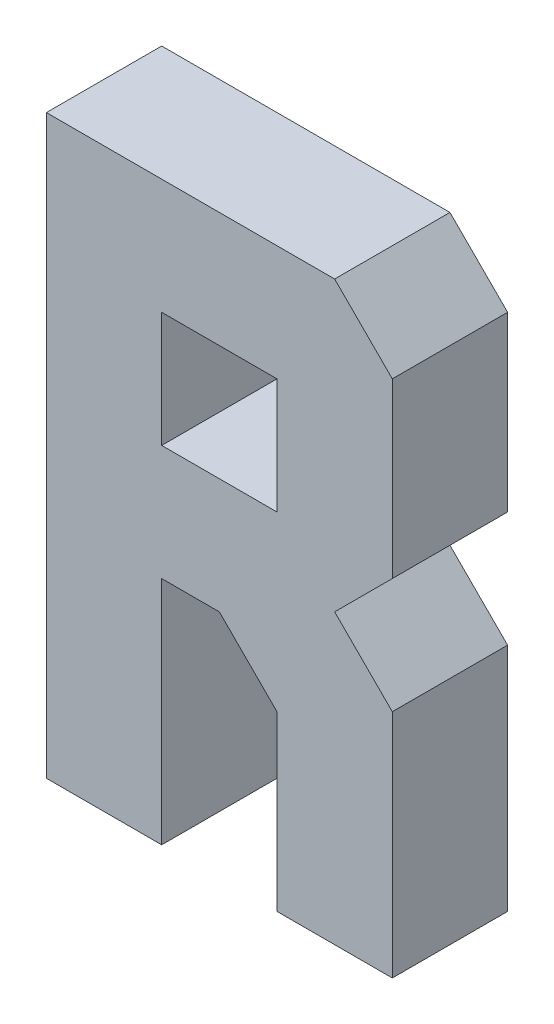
ISO-10303-21;
HEADER;
FILE_DESCRIPTION(('STEP AP214'),'2;1');
FILE_NAME('part.step','',(''),(''),'','','');
FILE_SCHEMA(('AUTOMOTIVE_DESIGN { 1 0 10303 214 1 1 1 1 }'));
ENDSEC;
DATA;
#1=APPLICATION_CONTEXT('core data for automotive mechanical design processes');
#2=APPLICATION_PROTOCOL_DEFINITION('international standard','automotive_design',2000,#1);
#3=PRODUCT_CONTEXT('',#1,'mechanical');
#4=PRODUCT('Part','Part','',(#3));
#5=PRODUCT_RELATED_PRODUCT_CATEGORY('part','',(#4));
#6=PRODUCT_DEFINITION_FORMATION('','',#4);
#7=PRODUCT_DEFINITION_CONTEXT('part definition',#1,'design');
#8=PRODUCT_DEFINITION('design','',#6,#7);
#9=PRODUCT_DEFINITION_SHAPE('','',#8);
#10=(LENGTH_UNIT() NAMED_UNIT(*) SI_UNIT(.MILLI.,.METRE.));
#11=(NAMED_UNIT(*) PLANE_ANGLE_UNIT() SI_UNIT($,.RADIAN.));
#12=(NAMED_UNIT(*) SI_UNIT($,.STERADIAN.) SOLID_ANGLE_UNIT());
#13=UNCERTAINTY_MEASURE_WITH_UNIT(LENGTH_MEASURE(1.E-05),#10,'distance_accuracy_value','');
#14=(GEOMETRIC_REPRESENTATION_CONTEXT(3) GLOBAL_UNCERTAINTY_ASSIGNED_CONTEXT((#13)) GLOBAL_UNIT_ASSIGNED_CONTEXT((#10,
#11,#12)) REPRESENTATION_CONTEXT('',''));
#15=CARTESIAN_POINT('',(0.,0.,0.));
#16=DIRECTION('',(0.,0.,1.));
#17=DIRECTION('',(1.,0.,0.));
#18=AXIS2_PLACEMENT_3D('',#15,#16,#17);
#19=CARTESIAN_POINT('',(0.,0.,10.));
#20=DIRECTION('',(0.,0.,-1.));
#21=DIRECTION('',(-1.,0.,0.));
#22=AXIS2_PLACEMENT_3D('',#19,#20,#21);
#23=PLANE('',#22);
#24=DIRECTION('',(0.,1.,0.));
#25=VECTOR('',#24,1.);
#26=CARTESIAN_POINT('',(30.,50.,10.));
#27=LINE('',#26,#25);
#28=CARTESIAN_POINT('',(30.,30.,10.));
#29=VERTEX_POINT('',#28);
#30=CARTESIAN_POINT('',(30.,45.,10.));
#31=VERTEX_POINT('',#30);
#32=EDGE_CURVE('E213',#29,#31,#27,.T.);
#33=ORIENTED_EDGE('',*,*,#32,.T.);
#34=DIRECTION('',(0.707106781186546,-0.707106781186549,0.));
#35=VECTOR('',#34,1.);
#36=CARTESIAN_POINT('',(25.,50.,10.));
#37=LINE('',#36,#35);
#38=CARTESIAN_POINT('',(25.,50.,10.));
#39=VERTEX_POINT('',#38);
#40=EDGE_CURVE('E11',#31,#39,#37,.F.);
#41=ORIENTED_EDGE('',*,*,#40,.T.);
#42=DIRECTION('',(-1.,0.,0.));
#43=VECTOR('',#42,1.);
#44=CARTESIAN_POINT('',(13.8454038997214,50.,10.));
#45=LINE('',#44,#43);
#46=CARTESIAN_POINT('',(0.,50.,10.));
#47=VERTEX_POINT('',#46);
#48=EDGE_CURVE('E215',#39,#47,#45,.T.);
#49=ORIENTED_EDGE('',*,*,#48,.T.);
#50=DIRECTION('',(0.,-1.,0.));
#51=VECTOR('',#50,1.);
#52=CARTESIAN_POINT('',(0.,0.,10.));
#53=LINE('',#52,#51);
#54=CARTESIAN_POINT('',(0.,0.,10.));
#55=VERTEX_POINT('',#54);
#56=EDGE_CURVE('E195',#47,#55,#53,.T.);
#57=ORIENTED_EDGE('',*,*,#56,.T.);
#58=DIRECTION('',(1.,0.,0.));
#59=VECTOR('',#58,1.);
#60=CARTESIAN_POINT('',(0.,0.,10.));
#61=LINE('',#60,#59);
#62=CARTESIAN_POINT('',(10.,0.,10.));
#63=VERTEX_POINT('',#62);
#64=EDGE_CURVE('E198',#55,#63,#61,.T.);
#65=ORIENTED_EDGE('',*,*,#64,.T.);
#66=DIRECTION('',(0.,1.,0.));
#67=VECTOR('',#66,1.);
#68=CARTESIAN_POINT('',(10.,0.,10.));
#69=LINE('',#68,#67);
#70=CARTESIAN_POINT('',(10.,20.,10.));
#71=VERTEX_POINT('',#70);
#72=EDGE_CURVE('E201',#63,#71,#69,.T.);
#73=ORIENTED_EDGE('',*,*,#72,.T.);
#74=DIRECTION('',(1.,0.,0.));
#75=VECTOR('',#74,1.);
#76=CARTESIAN_POINT('',(10.,20.,10.));
#77=LINE('',#76,#75);
#78=CARTESIAN_POINT('',(15.,20.,10.));
#79=VERTEX_POINT('',#78);
#80=EDGE_CURVE('E203',#71,#79,#77,.T.);
#81=ORIENTED_EDGE('',*,*,#80,.T.);
#82=DIRECTION('',(-0.707106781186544,0.707106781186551,0.));
#83=VECTOR('',#82,1.);
#84=CARTESIAN_POINT('',(17.5000000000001,17.4999999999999,10.));
#85=LINE('',#84,#83);
#86=CARTESIAN_POINT('',(20.,15.,10.));
#87=VERTEX_POINT('',#86);
#88=EDGE_CURVE('E266',#79,#87,#85,.F.);
#89=ORIENTED_EDGE('',*,*,#88,.T.);
#90=DIRECTION('',(0.,-1.,0.));
#91=VECTOR('',#90,1.);
#92=CARTESIAN_POINT('',(20.,0.,10.));
#93=LINE('',#92,#91);
#94=CARTESIAN_POINT('',(20.,0.,10.));
#95=VERTEX_POINT('',#94);
#96=EDGE_CURVE('E206',#87,#95,#93,.T.);
#97=ORIENTED_EDGE('',*,*,#96,.T.);
#98=DIRECTION('',(1.,0.,0.));
#99=VECTOR('',#98,1.);
#100=CARTESIAN_POINT('',(30.,0.,10.));
#101=LINE('',#100,#99);
#102=CARTESIAN_POINT('',(30.,0.,10.));
#103=VERTEX_POINT('',#102);
#104=EDGE_CURVE('E208',#95,#103,#101,.T.);
#105=ORIENTED_EDGE('',*,*,#104,.T.);
#106=DIRECTION('',(0.,1.,0.));
#107=VECTOR('',#106,1.);
#108=CARTESIAN_POINT('',(30.,0.,10.));
#109=LINE('',#108,#107);
#110=CARTESIAN_POINT('',(30.,20.,10.));
#111=VERTEX_POINT('',#110);
#112=EDGE_CURVE('E210',#103,#111,#109,.T.);
#113=ORIENTED_EDGE('',*,*,#112,.T.);
#114=DIRECTION('',(0.707106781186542,-0.707106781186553,0.));
#115=VECTOR('',#114,1.);
#116=CARTESIAN_POINT('',(25.0000000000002,24.9999999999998,10.));
#117=LINE('',#116,#115);
#118=CARTESIAN_POINT('',(25.,25.0000000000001,10.));
#119=VERTEX_POINT('',#118);
#120=EDGE_CURVE('E270',#111,#119,#117,.F.);
#121=ORIENTED_EDGE('',*,*,#120,.T.);
#122=DIRECTION('',(-0.707106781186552,-0.707106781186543,0.));
#123=VECTOR('',#122,1.);
#124=CARTESIAN_POINT('',(-1.71728862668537E-13,1.71728862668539E-13,10.));
#125=LINE('',#124,#123);
#126=EDGE_CURVE('E274',#119,#29,#125,.F.);
#127=ORIENTED_EDGE('',*,*,#126,.T.);
#128=EDGE_LOOP('',(#33,#41,#49,#57,#65,#73,#81,#89,#97,#105,#113,#121,#127));
#129=FACE_BOUND('',#128,.T.);
#130=DIRECTION('',(0.,-1.,0.));
#131=VECTOR('',#130,1.);
#132=CARTESIAN_POINT('',(10.,40.,10.));
#133=LINE('',#132,#131);
#134=CARTESIAN_POINT('',(10.,40.,10.));
#135=VERTEX_POINT('',#134);
#136=CARTESIAN_POINT('',(10.,30.,10.));
#137=VERTEX_POINT('',#136);
#138=EDGE_CURVE('E153',#135,#137,#133,.T.);
#139=ORIENTED_EDGE('',*,*,#138,.F.);
#140=DIRECTION('',(-1.,0.,0.));
#141=VECTOR('',#140,1.);
#142=CARTESIAN_POINT('',(10.,40.,10.));
#143=LINE('',#142,#141);
#144=CARTESIAN_POINT('',(20.,40.,10.));
#145=VERTEX_POINT('',#144);
#146=EDGE_CURVE('E178',#145,#135,#143,.T.);
#147=ORIENTED_EDGE('',*,*,#146,.F.);
#148=DIRECTION('',(0.,1.,0.));
#149=VECTOR('',#148,1.);
#150=CARTESIAN_POINT('',(20.,40.,10.));
#151=LINE('',#150,#149);
#152=CARTESIAN_POINT('',(20.,30.,10.));
#153=VERTEX_POINT('',#152);
#154=EDGE_CURVE('E176',#153,#145,#151,.T.);
#155=ORIENTED_EDGE('',*,*,#154,.F.);
#156=DIRECTION('',(1.,0.,0.));
#157=VECTOR('',#156,1.);
#158=CARTESIAN_POINT('',(10.,30.,10.));
#159=LINE('',#158,#157);
#160=EDGE_CURVE('E163',#137,#153,#159,.T.);
#161=ORIENTED_EDGE('',*,*,#160,.F.);
#162=EDGE_LOOP('',(#139,#147,#155,#161));
#163=FACE_BOUND('',#162,.T.);
#164=ADVANCED_FACE('F33',(#129,#163),#23,.F.);
#165=CARTESIAN_POINT('',(0.,0.,0.));
#166=DIRECTION('',(0.,0.,-1.));
#167=DIRECTION('',(-1.,0.,0.));
#168=AXIS2_PLACEMENT_3D('',#165,#166,#167);
#169=PLANE('',#168);
#170=DIRECTION('',(-1.,0.,0.));
#171=VECTOR('',#170,1.);
#172=CARTESIAN_POINT('',(0.,50.,0.));
#173=LINE('',#172,#171);
#174=CARTESIAN_POINT('',(25.,50.,0.));
#175=VERTEX_POINT('',#174);
#176=CARTESIAN_POINT('',(0.,50.,0.));
#177=VERTEX_POINT('',#176);
#178=EDGE_CURVE('E199',#175,#177,#173,.T.);
#179=ORIENTED_EDGE('',*,*,#178,.F.);
#180=DIRECTION('',(-0.707106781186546,0.707106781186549,0.));
#181=VECTOR('',#180,1.);
#182=CARTESIAN_POINT('',(37.5,37.4999999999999,0.));
#183=LINE('',#182,#181);
#184=CARTESIAN_POINT('',(30.,45.,0.));
#185=VERTEX_POINT('',#184);
#186=EDGE_CURVE('E55',#175,#185,#183,.F.);
#187=ORIENTED_EDGE('',*,*,#186,.T.);
#188=DIRECTION('',(0.,1.,0.));
#189=VECTOR('',#188,1.);
#190=CARTESIAN_POINT('',(30.,50.,0.));
#191=LINE('',#190,#189);
#192=CARTESIAN_POINT('',(30.,30.,0.));
#193=VERTEX_POINT('',#192);
#194=EDGE_CURVE('E234',#193,#185,#191,.T.);
#195=ORIENTED_EDGE('',*,*,#194,.F.);
#196=DIRECTION('',(0.707106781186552,0.707106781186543,0.));
#197=VECTOR('',#196,1.);
#198=CARTESIAN_POINT('',(30.,30.,0.));
#199=LINE('',#198,#197);
#200=CARTESIAN_POINT('',(25.,25.0000000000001,0.));
#201=VERTEX_POINT('',#200);
#202=EDGE_CURVE('E272',#193,#201,#199,.F.);
#203=ORIENTED_EDGE('',*,*,#202,.T.);
#204=DIRECTION('',(-0.707106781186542,0.707106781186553,0.));
#205=VECTOR('',#204,1.);
#206=CARTESIAN_POINT('',(25.,25.0000000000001,0.));
#207=LINE('',#206,#205);
#208=CARTESIAN_POINT('',(30.,20.,0.));
#209=VERTEX_POINT('',#208);
#210=EDGE_CURVE('E268',#201,#209,#207,.F.);
#211=ORIENTED_EDGE('',*,*,#210,.T.);
#212=DIRECTION('',(0.,1.,0.));
#213=VECTOR('',#212,1.);
#214=CARTESIAN_POINT('',(30.,0.,0.));
#215=LINE('',#214,#213);
#216=CARTESIAN_POINT('',(30.,0.,0.));
#217=VERTEX_POINT('',#216);
#218=EDGE_CURVE('E231',#217,#209,#215,.T.);
#219=ORIENTED_EDGE('',*,*,#218,.F.);
#220=DIRECTION('',(1.,0.,0.));
#221=VECTOR('',#220,1.);
#222=CARTESIAN_POINT('',(30.,0.,0.));
#223=LINE('',#222,#221);
#224=CARTESIAN_POINT('',(20.,0.,0.));
#225=VERTEX_POINT('',#224);
#226=EDGE_CURVE('E229',#225,#217,#223,.T.);
#227=ORIENTED_EDGE('',*,*,#226,.F.);
#228=DIRECTION('',(0.,-1.,0.));
#229=VECTOR('',#228,1.);
#230=CARTESIAN_POINT('',(20.,0.,0.));
#231=LINE('',#230,#229);
#232=CARTESIAN_POINT('',(20.,15.,0.));
#233=VERTEX_POINT('',#232);
#234=EDGE_CURVE('E227',#233,#225,#231,.T.);
#235=ORIENTED_EDGE('',*,*,#234,.F.);
#236=DIRECTION('',(0.707106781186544,-0.707106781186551,0.));
#237=VECTOR('',#236,1.);
#238=CARTESIAN_POINT('',(20.,15.,0.));
#239=LINE('',#238,#237);
#240=CARTESIAN_POINT('',(15.,20.,0.));
#241=VERTEX_POINT('',#240);
#242=EDGE_CURVE('E264',#233,#241,#239,.F.);
#243=ORIENTED_EDGE('',*,*,#242,.T.);
#244=DIRECTION('',(1.,0.,0.));
#245=VECTOR('',#244,1.);
#246=CARTESIAN_POINT('',(10.,20.,0.));
#247=LINE('',#246,#245);
#248=CARTESIAN_POINT('',(10.,20.,0.));
#249=VERTEX_POINT('',#248);
#250=EDGE_CURVE('E224',#249,#241,#247,.T.);
#251=ORIENTED_EDGE('',*,*,#250,.F.);
#252=DIRECTION('',(0.,1.,0.));
#253=VECTOR('',#252,1.);
#254=CARTESIAN_POINT('',(10.,0.,0.));
#255=LINE('',#254,#253);
#256=CARTESIAN_POINT('',(10.,0.,0.));
#257=VERTEX_POINT('',#256);
#258=EDGE_CURVE('E222',#257,#249,#255,.T.);
#259=ORIENTED_EDGE('',*,*,#258,.F.);
#260=DIRECTION('',(1.,0.,0.));
#261=VECTOR('',#260,1.);
#262=CARTESIAN_POINT('',(0.,0.,0.));
#263=LINE('',#262,#261);
#264=CARTESIAN_POINT('',(0.,0.,0.));
#265=VERTEX_POINT('',#264);
#266=EDGE_CURVE('E220',#265,#257,#263,.T.);
#267=ORIENTED_EDGE('',*,*,#266,.F.);
#268=DIRECTION('',(0.,-1.,0.));
#269=VECTOR('',#268,1.);
#270=CARTESIAN_POINT('',(0.,0.,0.));
#271=LINE('',#270,#269);
#272=EDGE_CURVE('E171',#177,#265,#271,.T.);
#273=ORIENTED_EDGE('',*,*,#272,.F.);
#274=EDGE_LOOP('',(#179,#187,#195,#203,#211,#219,#227,#235,#243,#251,#259,#267,#273));
#275=FACE_BOUND('',#274,.T.);
#276=DIRECTION('',(-1.,0.,0.));
#277=VECTOR('',#276,1.);
#278=CARTESIAN_POINT('',(10.,40.,0.));
#279=LINE('',#278,#277);
#280=CARTESIAN_POINT('',(20.,40.,0.));
#281=VERTEX_POINT('',#280);
#282=CARTESIAN_POINT('',(10.,40.,0.));
#283=VERTEX_POINT('',#282);
#284=EDGE_CURVE('E164',#281,#283,#279,.T.);
#285=ORIENTED_EDGE('',*,*,#284,.T.);
#286=DIRECTION('',(0.,-1.,0.));
#287=VECTOR('',#286,1.);
#288=CARTESIAN_POINT('',(10.,40.,0.));
#289=LINE('',#288,#287);
#290=CARTESIAN_POINT('',(10.,30.,0.));
#291=VERTEX_POINT('',#290);
#292=EDGE_CURVE('E182',#283,#291,#289,.T.);
#293=ORIENTED_EDGE('',*,*,#292,.T.);
#294=DIRECTION('',(1.,0.,0.));
#295=VECTOR('',#294,1.);
#296=CARTESIAN_POINT('',(10.,30.,0.));
#297=LINE('',#296,#295);
#298=CARTESIAN_POINT('',(20.,30.,0.));
#299=VERTEX_POINT('',#298);
#300=EDGE_CURVE('E170',#291,#299,#297,.T.);
#301=ORIENTED_EDGE('',*,*,#300,.T.);
#302=DIRECTION('',(0.,1.,0.));
#303=VECTOR('',#302,1.);
#304=CARTESIAN_POINT('',(20.,40.,0.));
#305=LINE('',#304,#303);
#306=EDGE_CURVE('E186',#299,#281,#305,.T.);
#307=ORIENTED_EDGE('',*,*,#306,.T.);
#308=EDGE_LOOP('',(#285,#293,#301,#307));
#309=FACE_BOUND('',#308,.T.);
#310=ADVANCED_FACE('F289',(#275,#309),#169,.T.);
#311=CARTESIAN_POINT('',(0.,0.,10.));
#312=DIRECTION('',(1.,0.,0.));
#313=DIRECTION('',(0.,0.,-1.));
#314=AXIS2_PLACEMENT_3D('',#311,#312,#313);
#315=PLANE('',#314);
#316=ORIENTED_EDGE('',*,*,#272,.T.);
#317=DIRECTION('',(0.,0.,-1.));
#318=VECTOR('',#317,1.);
#319=CARTESIAN_POINT('',(0.,0.,10.));
#320=LINE('',#319,#318);
#321=EDGE_CURVE('E256',#55,#265,#320,.T.);
#322=ORIENTED_EDGE('',*,*,#321,.F.);
#323=ORIENTED_EDGE('',*,*,#56,.F.);
#324=DIRECTION('',(0.,0.,-1.));
#325=VECTOR('',#324,1.);
#326=CARTESIAN_POINT('',(0.,50.,10.));
#327=LINE('',#326,#325);
#328=EDGE_CURVE('E217',#47,#177,#327,.T.);
#329=ORIENTED_EDGE('',*,*,#328,.T.);
#330=EDGE_LOOP('',(#316,#322,#323,#329));
#331=FACE_BOUND('',#330,.T.);
#332=ADVANCED_FACE('F294',(#331),#315,.F.);
#333=CARTESIAN_POINT('',(0.,0.,10.));
#334=DIRECTION('',(0.,1.,0.));
#335=DIRECTION('',(0.,0.,1.));
#336=AXIS2_PLACEMENT_3D('',#333,#334,#335);
#337=PLANE('',#336);
#338=ORIENTED_EDGE('',*,*,#266,.T.);
#339=DIRECTION('',(0.,0.,-1.));
#340=VECTOR('',#339,1.);
#341=CARTESIAN_POINT('',(10.,0.,10.));
#342=LINE('',#341,#340);
#343=EDGE_CURVE('E253',#63,#257,#342,.T.);
#344=ORIENTED_EDGE('',*,*,#343,.F.);
#345=ORIENTED_EDGE('',*,*,#64,.F.);
#346=ORIENTED_EDGE('',*,*,#321,.T.);
#347=EDGE_LOOP('',(#338,#344,#345,#346));
#348=FACE_BOUND('',#347,.T.);
#349=ADVANCED_FACE('F339',(#348),#337,.F.);
#350=CARTESIAN_POINT('',(10.,0.,10.));
#351=DIRECTION('',(-1.,0.,0.));
#352=DIRECTION('',(0.,0.,1.));
#353=AXIS2_PLACEMENT_3D('',#350,#351,#352);
#354=PLANE('',#353);
#355=ORIENTED_EDGE('',*,*,#258,.T.);
#356=DIRECTION('',(0.,0.,-1.));
#357=VECTOR('',#356,1.);
#358=CARTESIAN_POINT('',(10.,20.,10.));
#359=LINE('',#358,#357);
#360=EDGE_CURVE('E250',#71,#249,#359,.T.);
#361=ORIENTED_EDGE('',*,*,#360,.F.);
#362=ORIENTED_EDGE('',*,*,#72,.F.);
#363=ORIENTED_EDGE('',*,*,#343,.T.);
#364=EDGE_LOOP('',(#355,#361,#362,#363));
#365=FACE_BOUND('',#364,.T.);
#366=ADVANCED_FACE('F335',(#365),#354,.F.);
#367=CARTESIAN_POINT('',(10.,20.,10.));
#368=DIRECTION('',(0.,1.,0.));
#369=DIRECTION('',(0.,0.,1.));
#370=AXIS2_PLACEMENT_3D('',#367,#368,#369);
#371=PLANE('',#370);
#372=ORIENTED_EDGE('',*,*,#250,.T.);
#373=DIRECTION('',(0.,0.,1.));
#374=VECTOR('',#373,1.);
#375=CARTESIAN_POINT('',(15.,20.,10.));
#376=LINE('',#375,#374);
#377=EDGE_CURVE('E262',#241,#79,#376,.T.);
#378=ORIENTED_EDGE('',*,*,#377,.T.);
#379=ORIENTED_EDGE('',*,*,#80,.F.);
#380=ORIENTED_EDGE('',*,*,#360,.T.);
#381=EDGE_LOOP('',(#372,#378,#379,#380));
#382=FACE_BOUND('',#381,.T.);
#383=ADVANCED_FACE('F331',(#382),#371,.F.);
#384=CARTESIAN_POINT('',(20.,0.,10.));
#385=DIRECTION('',(1.,0.,0.));
#386=DIRECTION('',(0.,0.,-1.));
#387=AXIS2_PLACEMENT_3D('',#384,#385,#386);
#388=PLANE('',#387);
#389=ORIENTED_EDGE('',*,*,#96,.F.);
#390=DIRECTION('',(0.,0.,-1.));
#391=VECTOR('',#390,1.);
#392=CARTESIAN_POINT('',(20.,15.,0.));
#393=LINE('',#392,#391);
#394=EDGE_CURVE('E259',#87,#233,#393,.T.);
#395=ORIENTED_EDGE('',*,*,#394,.T.);
#396=ORIENTED_EDGE('',*,*,#234,.T.);
#397=DIRECTION('',(0.,0.,-1.));
#398=VECTOR('',#397,1.);
#399=CARTESIAN_POINT('',(20.,0.,10.));
#400=LINE('',#399,#398);
#401=EDGE_CURVE('E247',#95,#225,#400,.T.);
#402=ORIENTED_EDGE('',*,*,#401,.F.);
#403=EDGE_LOOP('',(#389,#395,#396,#402));
#404=FACE_BOUND('',#403,.T.);
#405=ADVANCED_FACE('F327',(#404),#388,.F.);
#406=CARTESIAN_POINT('',(30.,0.,10.));
#407=DIRECTION('',(0.,1.,0.));
#408=DIRECTION('',(0.,0.,1.));
#409=AXIS2_PLACEMENT_3D('',#406,#407,#408);
#410=PLANE('',#409);
#411=ORIENTED_EDGE('',*,*,#226,.T.);
#412=DIRECTION('',(0.,0.,-1.));
#413=VECTOR('',#412,1.);
#414=CARTESIAN_POINT('',(30.,0.,10.));
#415=LINE('',#414,#413);
#416=EDGE_CURVE('E244',#103,#217,#415,.T.);
#417=ORIENTED_EDGE('',*,*,#416,.F.);
#418=ORIENTED_EDGE('',*,*,#104,.F.);
#419=ORIENTED_EDGE('',*,*,#401,.T.);
#420=EDGE_LOOP('',(#411,#417,#418,#419));
#421=FACE_BOUND('',#420,.T.);
#422=ADVANCED_FACE('F323',(#421),#410,.F.);
#423=CARTESIAN_POINT('',(30.,0.,10.));
#424=DIRECTION('',(-1.,0.,0.));
#425=DIRECTION('',(0.,0.,1.));
#426=AXIS2_PLACEMENT_3D('',#423,#424,#425);
#427=PLANE('',#426);
#428=ORIENTED_EDGE('',*,*,#218,.T.);
#429=DIRECTION('',(0.,0.,-1.));
#430=VECTOR('',#429,1.);
#431=CARTESIAN_POINT('',(30.,20.,10.));
#432=LINE('',#431,#430);
#433=EDGE_CURVE('E241',#111,#209,#432,.T.);
#434=ORIENTED_EDGE('',*,*,#433,.F.);
#435=ORIENTED_EDGE('',*,*,#112,.F.);
#436=ORIENTED_EDGE('',*,*,#416,.T.);
#437=EDGE_LOOP('',(#428,#434,#435,#436));
#438=FACE_BOUND('',#437,.T.);
#439=ADVANCED_FACE('F320',(#438),#427,.F.);
#440=CARTESIAN_POINT('',(30.,50.,10.));
#441=DIRECTION('',(-1.,0.,0.));
#442=DIRECTION('',(0.,0.,1.));
#443=AXIS2_PLACEMENT_3D('',#440,#441,#442);
#444=PLANE('',#443);
#445=ORIENTED_EDGE('',*,*,#194,.T.);
#446=DIRECTION('',(0.,0.,1.));
#447=VECTOR('',#446,1.);
#448=CARTESIAN_POINT('',(30.,45.,10.));
#449=LINE('',#448,#447);
#450=EDGE_CURVE('E41',#185,#31,#449,.T.);
#451=ORIENTED_EDGE('',*,*,#450,.T.);
#452=ORIENTED_EDGE('',*,*,#32,.F.);
#453=DIRECTION('',(0.,0.,-1.));
#454=VECTOR('',#453,1.);
#455=CARTESIAN_POINT('',(30.,30.,10.));
#456=LINE('',#455,#454);
#457=EDGE_CURVE('E239',#29,#193,#456,.T.);
#458=ORIENTED_EDGE('',*,*,#457,.T.);
#459=EDGE_LOOP('',(#445,#451,#452,#458));
#460=FACE_BOUND('',#459,.T.);
#461=ADVANCED_FACE('F317',(#460),#444,.F.);
#462=CARTESIAN_POINT('',(0.,50.,10.));
#463=DIRECTION('',(0.,-1.,0.));
#464=DIRECTION('',(0.,0.,-1.));
#465=AXIS2_PLACEMENT_3D('',#462,#463,#464);
#466=PLANE('',#465);
#467=ORIENTED_EDGE('',*,*,#48,.F.);
#468=DIRECTION('',(0.,0.,-1.));
#469=VECTOR('',#468,1.);
#470=CARTESIAN_POINT('',(25.,50.,10.));
#471=LINE('',#470,#469);
#472=EDGE_CURVE('E276',#39,#175,#471,.T.);
#473=ORIENTED_EDGE('',*,*,#472,.T.);
#474=ORIENTED_EDGE('',*,*,#178,.T.);
#475=ORIENTED_EDGE('',*,*,#328,.F.);
#476=EDGE_LOOP('',(#467,#473,#474,#475));
#477=FACE_BOUND('',#476,.T.);
#478=ADVANCED_FACE('F284',(#477),#466,.F.);
#479=CARTESIAN_POINT('',(10.,40.,10.));
#480=DIRECTION('',(1.,0.,0.));
#481=DIRECTION('',(0.,1.,0.));
#482=AXIS2_PLACEMENT_3D('',#479,#480,#481);
#483=PLANE('',#482);
#484=ORIENTED_EDGE('',*,*,#292,.F.);
#485=DIRECTION('',(0.,0.,-1.));
#486=VECTOR('',#485,1.);
#487=CARTESIAN_POINT('',(10.,40.,10.));
#488=LINE('',#487,#486);
#489=EDGE_CURVE('E159',#135,#283,#488,.T.);
#490=ORIENTED_EDGE('',*,*,#489,.F.);
#491=ORIENTED_EDGE('',*,*,#138,.T.);
#492=DIRECTION('',(0.,0.,-1.));
#493=VECTOR('',#492,1.);
#494=CARTESIAN_POINT('',(10.,30.,10.));
#495=LINE('',#494,#493);
#496=EDGE_CURVE('E156',#137,#291,#495,.T.);
#497=ORIENTED_EDGE('',*,*,#496,.T.);
#498=EDGE_LOOP('',(#484,#490,#491,#497));
#499=FACE_BOUND('',#498,.T.);
#500=ADVANCED_FACE('F155',(#499),#483,.T.);
#501=CARTESIAN_POINT('',(10.,30.,10.));
#502=DIRECTION('',(0.,1.,0.));
#503=DIRECTION('',(0.,0.,1.));
#504=AXIS2_PLACEMENT_3D('',#501,#502,#503);
#505=PLANE('',#504);
#506=ORIENTED_EDGE('',*,*,#300,.F.);
#507=ORIENTED_EDGE('',*,*,#496,.F.);
#508=ORIENTED_EDGE('',*,*,#160,.T.);
#509=DIRECTION('',(0.,0.,-1.));
#510=VECTOR('',#509,1.);
#511=CARTESIAN_POINT('',(20.,30.,10.));
#512=LINE('',#511,#510);
#513=EDGE_CURVE('E172',#153,#299,#512,.T.);
#514=ORIENTED_EDGE('',*,*,#513,.T.);
#515=EDGE_LOOP('',(#506,#507,#508,#514));
#516=FACE_BOUND('',#515,.T.);
#517=ADVANCED_FACE('F167',(#516),#505,.T.);
#518=CARTESIAN_POINT('',(20.,40.,10.));
#519=DIRECTION('',(-1.,0.,0.));
#520=DIRECTION('',(0.,-1.,0.));
#521=AXIS2_PLACEMENT_3D('',#518,#519,#520);
#522=PLANE('',#521);
#523=ORIENTED_EDGE('',*,*,#306,.F.);
#524=ORIENTED_EDGE('',*,*,#513,.F.);
#525=ORIENTED_EDGE('',*,*,#154,.T.);
#526=DIRECTION('',(0.,0.,-1.));
#527=VECTOR('',#526,1.);
#528=CARTESIAN_POINT('',(20.,40.,10.));
#529=LINE('',#528,#527);
#530=EDGE_CURVE('E192',#145,#281,#529,.T.);
#531=ORIENTED_EDGE('',*,*,#530,.T.);
#532=EDGE_LOOP('',(#523,#524,#525,#531));
#533=FACE_BOUND('',#532,.T.);
#534=ADVANCED_FACE('F425',(#533),#522,.T.);
#535=CARTESIAN_POINT('',(10.,40.,10.));
#536=DIRECTION('',(0.,-1.,0.));
#537=DIRECTION('',(0.,0.,-1.));
#538=AXIS2_PLACEMENT_3D('',#535,#536,#537);
#539=PLANE('',#538);
#540=ORIENTED_EDGE('',*,*,#284,.F.);
#541=ORIENTED_EDGE('',*,*,#530,.F.);
#542=ORIENTED_EDGE('',*,*,#146,.T.);
#543=ORIENTED_EDGE('',*,*,#489,.T.);
#544=EDGE_LOOP('',(#540,#541,#542,#543));
#545=FACE_BOUND('',#544,.T.);
#546=ADVANCED_FACE('F348',(#545),#539,.T.);
#547=CARTESIAN_POINT('',(20.,15.,10.));
#548=DIRECTION('',(-0.707106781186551,-0.707106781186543,0.));
#549=DIRECTION('',(0.,0.,1.));
#550=AXIS2_PLACEMENT_3D('',#547,#548,#549);
#551=PLANE('',#550);
#552=ORIENTED_EDGE('',*,*,#88,.F.);
#553=ORIENTED_EDGE('',*,*,#377,.F.);
#554=ORIENTED_EDGE('',*,*,#242,.F.);
#555=ORIENTED_EDGE('',*,*,#394,.F.);
#556=EDGE_LOOP('',(#552,#553,#554,#555));
#557=FACE_BOUND('',#556,.T.);
#558=ADVANCED_FACE('F346',(#557),#551,.T.);
#559=CARTESIAN_POINT('',(30.,30.,10.));
#560=DIRECTION('',(0.707106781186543,-0.707106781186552,0.));
#561=DIRECTION('',(0.,0.,1.));
#562=AXIS2_PLACEMENT_3D('',#559,#560,#561);
#563=PLANE('',#562);
#564=ORIENTED_EDGE('',*,*,#457,.F.);
#565=ORIENTED_EDGE('',*,*,#126,.F.);
#566=DIRECTION('',(0.,0.,1.));
#567=VECTOR('',#566,1.);
#568=CARTESIAN_POINT('',(25.,25.,10.));
#569=LINE('',#568,#567);
#570=EDGE_CURVE('E184',#201,#119,#569,.T.);
#571=ORIENTED_EDGE('',*,*,#570,.F.);
#572=ORIENTED_EDGE('',*,*,#202,.F.);
#573=EDGE_LOOP('',(#564,#565,#571,#572));
#574=FACE_BOUND('',#573,.T.);
#575=ADVANCED_FACE('F303',(#574),#563,.T.);
#576=CARTESIAN_POINT('',(25.,25.0000000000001,10.));
#577=DIRECTION('',(0.707106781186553,0.707106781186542,0.));
#578=DIRECTION('',(0.,0.,1.));
#579=AXIS2_PLACEMENT_3D('',#576,#577,#578);
#580=PLANE('',#579);
#581=ORIENTED_EDGE('',*,*,#120,.F.);
#582=ORIENTED_EDGE('',*,*,#433,.T.);
#583=ORIENTED_EDGE('',*,*,#210,.F.);
#584=ORIENTED_EDGE('',*,*,#570,.T.);
#585=EDGE_LOOP('',(#581,#582,#583,#584));
#586=FACE_BOUND('',#585,.T.);
#587=ADVANCED_FACE('F299',(#586),#580,.T.);
#588=CARTESIAN_POINT('',(25.,50.,10.));
#589=DIRECTION('',(-0.707106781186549,-0.707106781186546,0.));
#590=DIRECTION('',(0.,0.,-1.));
#591=AXIS2_PLACEMENT_3D('',#588,#589,#590);
#592=PLANE('',#591);
#593=ORIENTED_EDGE('',*,*,#40,.F.);
#594=ORIENTED_EDGE('',*,*,#450,.F.);
#595=ORIENTED_EDGE('',*,*,#186,.F.);
#596=ORIENTED_EDGE('',*,*,#472,.F.);
#597=EDGE_LOOP('',(#593,#594,#595,#596));
#598=FACE_BOUND('',#597,.T.);
#599=ADVANCED_FACE('F35',(#598),#592,.F.);
#600=CLOSED_SHELL('',(#164,#310,#332,#349,#366,#383,#405,#422,#439,#461,#478,#500,#517,#534,
#546,#558,#575,#587,#599));
#601=MANIFOLD_SOLID_BREP('B2',#600);
#602=ADVANCED_BREP_SHAPE_REPRESENTATION('',(#18,#601),#14);
#603=SHAPE_DEFINITION_REPRESENTATION(#9,#602);
ENDSEC;
END-ISO-10303-21;
